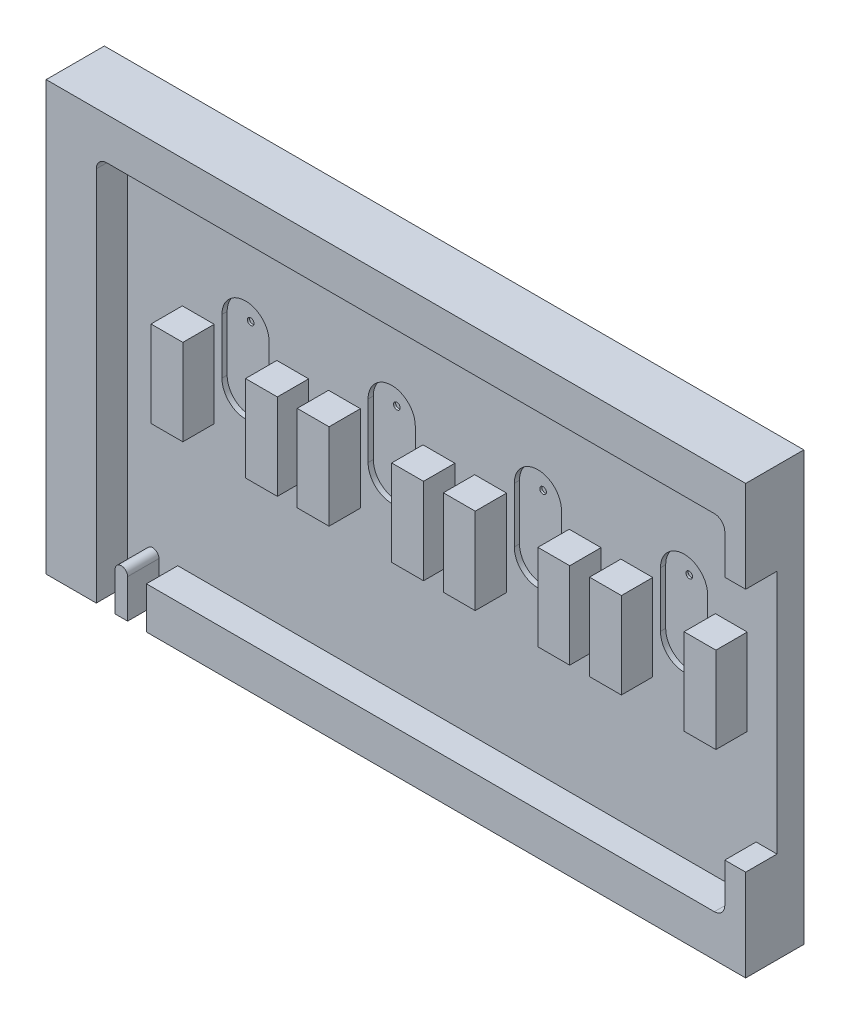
from build123d import *

# Parameters (mm, degrees)
SKETCH1_W           = 14
SKETCH1_H           = 16
EXTRUDE1_DEPTH      = 2.47
SKETCH3_W           = 2.3
SKETCH3_H           = 8.25
EXTRUDE2_DEPTH      = 2.58
LPATTERN1_COUNT     = 4
LPATTERN1_PITCH     = 14
EXTRUDE4_DEPTH      = 2.58
EXTRUDE4_DEPTH_BACK = 2.47
SKETCH6_W           = 64
SKETCH6_H           = 24
SKETCH6_W_2         = 56
SKETCH6_H_2         = 16
FILLET3_R           = 2
FILLET4_R           = 2
FILLET5_R           = 2
FILLET6_R           = 2
SKETCH10_W          = 64
SKETCH10_H          = 24
CUT_EXTRUDE12_DEPTH = 0.1
CUT_EXTRUDE14_DEPTH = 0.5
SKETCH14_R          = 0.3175
CUT_EXTRUDE15_DEPTH = 0.2
LPATTERN2_COUNT     = 4
LPATTERN2_PITCH     = 14
CUT_EXTRUDE19_START = -2.58
SKETCH20_W          = 64
SKETCH20_H          = 24
CUT_EXTRUDE19_DEPTH = 2.58
SKETCH21_W          = 64
SKETCH21_H          = 9.16
EXTRUDE7_DEPTH      = 2.37
SKETCH22_W          = 4.1
SKETCH22_H          = 33.16
CUT_EXTRUDE20_DEPTH = 2.37
CUT_EXTRUDE21_REACH = 61.426
SKETCH23_W          = 59.9
SKETCH23_H          = 0.14
CUT_EXTRUDE23_REACH = 61.379
SKETCH25_W          = 0.91
SKETCH25_H          = 33.02
SKETCH26_W          = 3.6
SKETCH26_H          = 4.15
EXTRUDE9_DEPTH      = 2.37
EXTRUDE10_DEPTH     = 4.95
FILLET7_R           = 2
SKETCH29_W          = 4
SKETCH29_H          = 27.02
CUT_EXTRUDE25_DEPTH = 2.58
FILLET13_R          = 1
FILLET14_R          = 1
SKETCH30_W          = 4.8
SKETCH30_H          = 41.17
CUT_EXTRUDE26_DEPTH = 2.58
EXTRUDE11_DEPTH     = 2.58
EXTRUDE12_START     = 0.42
SKETCH32_W          = 2.3
SKETCH32_H          = 8.25
EXTRUDE12_DEPTH     = 0.42
SKETCH33_W          = 0.75
SKETCH33_H          = 8.25
EXTRUDE13_DEPTH     = 3
SKETCH34_W          = 0.75
SKETCH34_H          = 8.25
EXTRUDE14_DEPTH     = 3
LPATTERN3_COUNT     = 4
LPATTERN3_PITCH     = 14
SKETCH35_W          = 11.6
SKETCH35_H          = 4.15
CUT_EXTRUDE27_DEPTH = 63.85337302
SKETCH36_W          = 2
SKETCH36_H          = 1.78
EXTRUDE15_DEPTH     = 3
FILLET15_R          = 1
SKETCH37_W          = 66.99
SKETCH37_H          = 41.02
EXTRUDE16_DEPTH     = 0.2


with BuildPart() as part:
    # Sketch1 → Extrude1 (new body)
    with BuildSketch(Plane.XY):
        with Locations((7, 8)):
            Rectangle(SKETCH1_W, SKETCH1_H)
    extrude(amount=-EXTRUDE1_DEPTH)

    # Sketch3 → Extrude2 (add)
    with BuildSketch(Plane.XY):
        with Locations((2.85, 4.485)):
            Rectangle(SKETCH3_W, SKETCH3_H)
        with Locations((11.15, 4.485)):
            Rectangle(SKETCH3_W, SKETCH3_H)
    extrude(amount=EXTRUDE2_DEPTH)


with BuildPart() as lpattern1_1:
    # LPattern1: pattern copy
    add(part.part.moved(Location(Vector(1, 0, 0) * (1 * LPATTERN1_PITCH))))


with BuildPart() as lpattern1_2:
    # LPattern1: pattern copy
    add(part.part.moved(Location(Vector(1, 0, 0) * (2 * LPATTERN1_PITCH))))


with BuildPart() as lpattern1_3:
    # LPattern1: pattern copy
    add(part.part.moved(Location(Vector(1, 0, 0) * (3 * LPATTERN1_PITCH))))


with BuildPart() as part_1:
    add(part.part)

    add(lpattern1_1.part)  # Extrude4 merges LPattern1_1

    add(lpattern1_2.part)  # Extrude4 merges LPattern1_2

    add(lpattern1_3.part)  # Extrude4 merges LPattern1_3
    # Sketch6 → Extrude4 (add, two sides: drawn at the far end of the back side and taken through both)
    with BuildSketch(Plane.XY.offset(-EXTRUDE4_DEPTH_BACK)):
        with Locations((28, 8)):
            Rectangle(SKETCH6_W, SKETCH6_H)
        with Locations((28, 8)):
            Rectangle(SKETCH6_W_2, SKETCH6_H_2, mode=Mode.SUBTRACT)
    extrude(amount=EXTRUDE4_DEPTH + EXTRUDE4_DEPTH_BACK)

    # Fillet3
    fillet3_edges = [part_1.edges().sort_by_distance(p)[0] for p in [
        (0, 16, 1.29),
    ]]
    fillet(fillet3_edges, radius=FILLET3_R)

    # Fillet4
    fillet4_edges = [part_1.edges().sort_by_distance(p)[0] for p in [
        (56, 16, 1.29),
    ]]
    fillet(fillet4_edges, radius=FILLET4_R)

    # Fillet5
    fillet5_edges = [part_1.edges().sort_by_distance(p)[0] for p in [
        (56, 0, 1.29),
    ]]
    fillet(fillet5_edges, radius=FILLET5_R)

    # Fillet6
    fillet6_edges = [part_1.edges().sort_by_distance(p)[0] for p in [
        (0, 0, 1.29),
    ]]
    fillet(fillet6_edges, radius=FILLET6_R)

    # Sketch10 → Cut-Extrude12 (cut)
    with BuildSketch(Plane(origin=(0, 0, -2.47), x_dir=(-1, 0, 0), z_dir=(0, 0, -1))):
        with Locations((-28, 8)):
            Rectangle(SKETCH10_W, SKETCH10_H)
    extrude(amount=-CUT_EXTRUDE12_DEPTH, mode=Mode.SUBTRACT)

    # Sketch13 → Cut-Extrude14 (cut)
    with BuildSketch(Plane.XY):
        with BuildLine():
            Line((9.26, 9.788786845), (9.26, 9.319886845))
            Line((9.26, 9.319886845), (9.26, 4.980113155))
            Line((9.26, 4.980113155), (9.26, 4.511213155))
            ThreePointArc((9.26, 4.511213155), (7, 2.251213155), (4.74, 4.511213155))
            Line((4.74, 4.511213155), (4.74, 4.980113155))
            Line((4.74, 4.980113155), (4.74, 9.319886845))
            Line((4.74, 9.319886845), (4.74, 9.788786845))
            ThreePointArc((4.74, 9.788786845), (7, 12.048786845), (9.26, 9.788786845))
        make_face()
    cut_extrude14 = extrude(amount=-CUT_EXTRUDE14_DEPTH, mode=Mode.SUBTRACT)

    # Sketch14 → Cut-Extrude15 (cut)
    with BuildSketch(Plane.XY.offset(-0.5)):
        with Locations((6.997564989, 4.222316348)):
            Circle(SKETCH14_R)
        with Locations((6.997564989, 10.077683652)):
            Circle(SKETCH14_R)
    cut_extrude15 = extrude(amount=-CUT_EXTRUDE15_DEPTH, mode=Mode.SUBTRACT)

    # LPattern2: Cut-Extrude14, Cut-Extrude15 ×4
    with Locations(*[(i * LPATTERN2_PITCH, 0, 0) for i in range(1, LPATTERN2_COUNT)]):
        add(cut_extrude14, mode=Mode.SUBTRACT)
        add(cut_extrude15, mode=Mode.SUBTRACT)

    # Sketch20 → Cut-Extrude19 (cut)
    with BuildSketch(Plane.XY.offset(2.58).offset(CUT_EXTRUDE19_START)):
        with Locations((28, 8)):
            Rectangle(SKETCH20_W, SKETCH20_H)
        with BuildLine():
            Line((0, 14), (0, 2))
            ThreePointArc((0, 2), (0.585786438, 0.585786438), (2, 0))
            Line((2, 0), (54, 0))
            ThreePointArc((54, 0), (55.414213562, 0.585786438), (56, 2))
            Line((56, 2), (56, 14))
            ThreePointArc((56, 14), (55.414213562, 15.414213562), (54, 16))
            Line((54, 16), (2, 16))
            ThreePointArc((2, 16), (0.585786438, 15.414213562), (0, 14))
        make_face(mode=Mode.SUBTRACT)
    extrude(amount=CUT_EXTRUDE19_DEPTH, mode=Mode.SUBTRACT)

    # Sketch21 → Extrude7 (add)
    with BuildSketch(Plane.XY):
        with Locations((28, -8.58)):
            Rectangle(SKETCH21_W, SKETCH21_H)
    extrude(amount=-EXTRUDE7_DEPTH)

    # Sketch22 → Cut-Extrude20 (cut)
    with BuildSketch(Plane.XY):
        with Locations((57.95, 3.42)):
            Rectangle(SKETCH22_W, SKETCH22_H)
    extrude(amount=-CUT_EXTRUDE20_DEPTH, mode=Mode.SUBTRACT)

    # Sketch23 → Cut-Extrude21 (cut, up to next)
    with BuildSketch(Plane.XY, mode=Mode.PRIVATE) as cut_extrude21_sk1:
        with Locations((25.95, 19.93)):
            Rectangle(SKETCH23_W, SKETCH23_H)
    cut_extrude21_tool1 = extrude(cut_extrude21_sk1.sketch, amount=-CUT_EXTRUDE21_REACH, mode=Mode.PRIVATE) & part_1.part
    add(cut_extrude21_tool1.solids().sort_by_distance((25.95, 19.93, 0))[0], mode=Mode.SUBTRACT)

    # Sketch25 → Cut-Extrude23 (cut, up to next)
    with BuildSketch(Plane.XY, mode=Mode.PRIVATE) as cut_extrude23_sk1:
        with Locations((-3.545, 3.35)):
            Rectangle(SKETCH25_W, SKETCH25_H)
    cut_extrude23_tool1 = extrude(cut_extrude23_sk1.sketch, amount=-CUT_EXTRUDE23_REACH, mode=Mode.PRIVATE) & part_1.part
    add(cut_extrude23_tool1.solids().sort_by_distance((-3.545, 3.35, 0))[0], mode=Mode.SUBTRACT)

    # Sketch26 → Extrude9 (add)
    with BuildSketch(Plane.XY):
        with Locations((-1.29, -15.235)):
            Rectangle(SKETCH26_W, SKETCH26_H)
    extrude(amount=-EXTRUDE9_DEPTH)

    # Sketch27 → Extrude10 (add)
    with BuildSketch(Plane(origin=(0, 0, -2.37), x_dir=(-1, 0, 0), z_dir=(0, 0, -1))):
        Polygon((1.49, -21.31), (-2.51, -21.31), (-2.51, -17.16), (-53.9, -17.16), (-57.9, -17.16), (-57.9, 23.86), (-53.9, 23.86), (9.09, 23.86), (9.09, -21.31), (5.09, -21.31), align=None)
        Polygon((3.09, 19.86), (-55.9, 19.86), (-55.9, -13.16), (-0.51, -13.16), (-0.51, -17.31), (3.09, -17.31), (3.09, -16.31), align=None, mode=Mode.SUBTRACT)
    extrude(amount=-EXTRUDE10_DEPTH)

    # Fillet7
    fillet7_edges = [part_1.edges().sort_by_distance(p)[0] for p in [
        (-3.09, 19.86, 1.29),
    ]]
    fillet(fillet7_edges, radius=FILLET7_R)

    # Sketch29 → Cut-Extrude25 (cut)
    with BuildSketch(Plane.XY.offset(2.58)):
        with Locations((57.9, 3.35)):
            Rectangle(SKETCH29_W, SKETCH29_H)
    extrude(amount=-CUT_EXTRUDE25_DEPTH, mode=Mode.SUBTRACT)

    # Fillet13
    fillet13_edges = [part_1.edges().sort_by_distance(p)[0] for p in [
        (55.9, -13.16, 1.29),
    ]]
    fillet(fillet13_edges, radius=FILLET13_R)

    # Fillet14
    fillet14_edges = [part_1.edges().sort_by_distance(p)[0] for p in [
        (55.9, 19.86, 1.29),
    ]]
    fillet(fillet14_edges, radius=FILLET14_R)

    # Sketch30 → Cut-Extrude26 (cut)
    with BuildSketch(Plane.XY.offset(2.58)):
        with Locations((-1.89, -0.725)):
            Rectangle(SKETCH30_W, SKETCH30_H)
    extrude(amount=-CUT_EXTRUDE26_DEPTH, mode=Mode.SUBTRACT)

    # Sketch31 → Extrude11 (add)
    with BuildSketch(Plane.XY):
        with BuildLine():
            Line((-1.29, -21.31), (-2.49, -21.31))
            Line((-2.49, -21.31), (-2.49, -13.465215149))
            ThreePointArc((-2.49, -13.465215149), (-1.89, -12.865215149), (-1.29, -13.465215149))
            Line((-1.29, -13.465215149), (-1.29, -21.31))
        make_face()
    extrude(amount=EXTRUDE11_DEPTH)

    # Sketch32 → Extrude12 (add)
    with BuildSketch(Plane.XY.offset(2.58).offset(EXTRUDE12_START)):
        with BuildLine():
            Line((-2.49, -21.31), (-1.29, -21.31))
            Line((-1.29, -21.31), (-1.29, -13.465215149))
            ThreePointArc((-1.29, -13.465215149), (-1.89, -12.865215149), (-2.49, -13.465215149))
            Line((-2.49, -13.465215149), (-2.49, -21.31))
        make_face()
        with BuildLine():
            Line((0.51, -13.16), (0.51, -21.31))
            Line((0.51, -21.31), (2.51, -21.31))
            Line((2.51, -21.31), (2.51, -17.16))
            Line((2.51, -17.16), (57.9, -17.16))
            Line((57.9, -17.16), (57.9, -10.16))
            Line((57.9, -10.16), (55.9, -10.16))
            Line((55.9, -10.16), (55.9, -12.16))
            ThreePointArc((55.9, -12.16), (55.607106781, -12.867106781), (54.9, -13.16))
            Line((54.9, -13.16), (0.51, -13.16))
        make_face()
        with BuildLine():
            Line((-4.29, -21.31), (-4.29, 19.86))
            Line((-4.29, 19.86), (54.9, 19.86))
            ThreePointArc((54.9, 19.86), (55.607106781, 19.567106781), (55.9, 18.86))
            Line((55.9, 18.86), (55.9, 16.86))
            Line((55.9, 16.86), (57.9, 16.86))
            Line((57.9, 16.86), (57.9, 23.86))
            Line((57.9, 23.86), (-9.09, 23.86))
            Line((-9.09, 23.86), (-9.09, -21.31))
            Line((-9.09, -21.31), (-4.29, -21.31))
        make_face()
        with Locations((53.15, 4.485)):
            Rectangle(SKETCH32_W, SKETCH32_H)
        with Locations((44.85, 4.485)):
            Rectangle(SKETCH32_W, SKETCH32_H)
        with Locations((39.15, 4.485)):
            Rectangle(SKETCH32_W, SKETCH32_H)
        with Locations((30.85, 4.485)):
            Rectangle(SKETCH32_W, SKETCH32_H)
        with Locations((25.15, 4.485)):
            Rectangle(SKETCH32_W, SKETCH32_H)
        with Locations((16.85, 4.485)):
            Rectangle(SKETCH32_W, SKETCH32_H)
        with Locations((11.15, 4.485)):
            Rectangle(SKETCH32_W, SKETCH32_H)
        with Locations((2.85, 4.485)):
            Rectangle(SKETCH32_W, SKETCH32_H)
    extrude(amount=-EXTRUDE12_DEPTH)

    # Sketch33 → Extrude13 (add)
    with BuildSketch(Plane.XY.offset(3)):
        with Locations((54.675, 4.485)):
            Rectangle(SKETCH33_W, SKETCH33_H)
        with Locations((43.325, 4.485)):
            Rectangle(SKETCH33_W, SKETCH33_H)
    extrude(amount=-EXTRUDE13_DEPTH)

    # Sketch34 → Extrude14 (add)
    with BuildSketch(Plane.XY.offset(3)):
        with Locations((54.675, 4.485)):
            Rectangle(SKETCH34_W, SKETCH34_H)
        with Locations((43.325, 4.485)):
            Rectangle(SKETCH34_W, SKETCH34_H)
    extrude14 = extrude(amount=-EXTRUDE14_DEPTH)

    # LPattern3: Extrude14 ×4
    with Locations(*[(-i * LPATTERN3_PITCH, 0, 0) for i in range(1, LPATTERN3_COUNT)]):
        add(extrude14)

    # Sketch35 → Cut-Extrude27 (cut, through all)
    with BuildSketch(Plane.XY.offset(3)):
        with Locations((-3.29, -19.235)):
            Rectangle(SKETCH35_W, SKETCH35_H)
    extrude(amount=-CUT_EXTRUDE27_DEPTH, mode=Mode.SUBTRACT)

    # Sketch36 → Extrude15 (add)
    with BuildSketch(Plane.XY.offset(3)):
        with Locations((56.9, 15.97)):
            Rectangle(SKETCH36_W, SKETCH36_H)
        with Locations((56.9, -9.27)):
            Rectangle(SKETCH36_W, SKETCH36_H)
    extrude(amount=-EXTRUDE15_DEPTH)

    # Fillet15
    fillet15_edges = [part_1.edges().sort_by_distance(p)[0] for p in [
        (-4.29, 19.86, 1.5),
    ]]
    fillet(fillet15_edges, radius=FILLET15_R)

    # Sketch37 → Extrude16 (add)
    with BuildSketch(Plane(origin=(0, 0, -2.37), x_dir=(-1, 0, 0), z_dir=(0, 0, -1))):
        with Locations((-24.405, 3.35)):
            Rectangle(SKETCH37_W, SKETCH37_H)
    extrude(amount=EXTRUDE16_DEPTH)


solid = part_1.part
